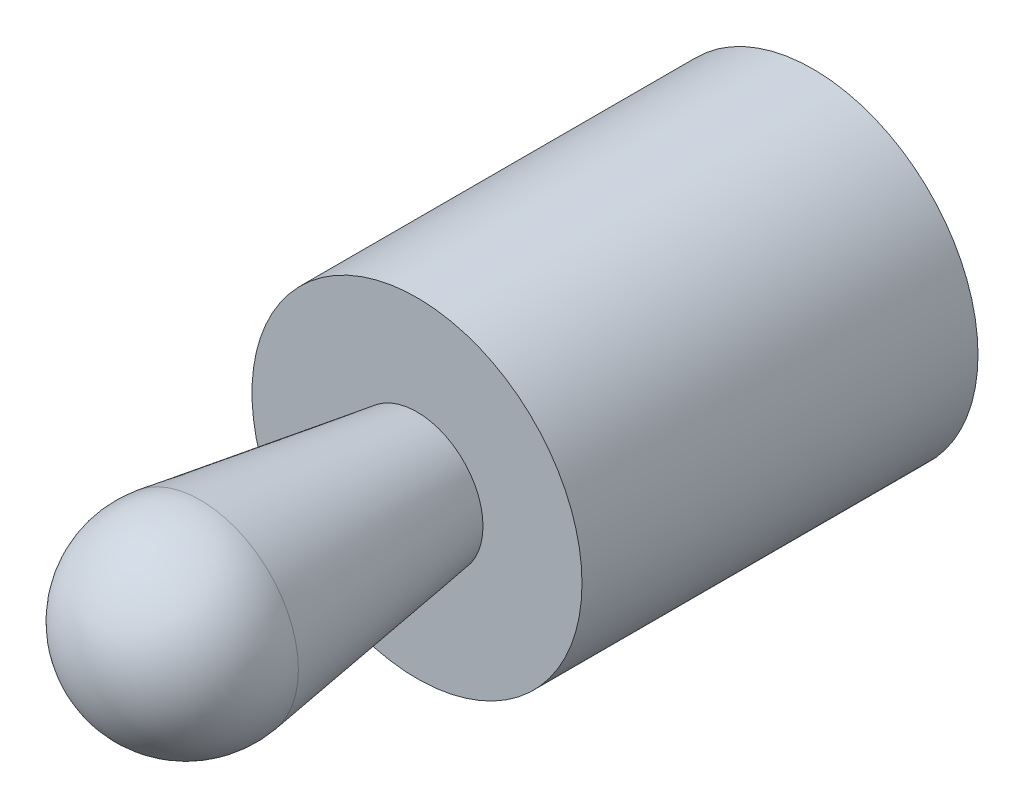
ISO-10303-21;
HEADER;
FILE_DESCRIPTION(('STEP AP214'),'2;1');
FILE_NAME('part.step','',(''),(''),'','','');
FILE_SCHEMA(('AUTOMOTIVE_DESIGN { 1 0 10303 214 1 1 1 1 }'));
ENDSEC;
DATA;
#1=APPLICATION_CONTEXT('core data for automotive mechanical design processes');
#2=APPLICATION_PROTOCOL_DEFINITION('international standard','automotive_design',2000,#1);
#3=PRODUCT_CONTEXT('',#1,'mechanical');
#4=PRODUCT('Part','Part','',(#3));
#5=PRODUCT_RELATED_PRODUCT_CATEGORY('part','',(#4));
#6=PRODUCT_DEFINITION_FORMATION('','',#4);
#7=PRODUCT_DEFINITION_CONTEXT('part definition',#1,'design');
#8=PRODUCT_DEFINITION('design','',#6,#7);
#9=PRODUCT_DEFINITION_SHAPE('','',#8);
#10=(LENGTH_UNIT() NAMED_UNIT(*) SI_UNIT(.MILLI.,.METRE.));
#11=(NAMED_UNIT(*) PLANE_ANGLE_UNIT() SI_UNIT($,.RADIAN.));
#12=(NAMED_UNIT(*) SI_UNIT($,.STERADIAN.) SOLID_ANGLE_UNIT());
#13=UNCERTAINTY_MEASURE_WITH_UNIT(LENGTH_MEASURE(1.E-05),#10,'distance_accuracy_value','');
#14=(GEOMETRIC_REPRESENTATION_CONTEXT(3) GLOBAL_UNCERTAINTY_ASSIGNED_CONTEXT((#13)) GLOBAL_UNIT_ASSIGNED_CONTEXT((#10,
#11,#12)) REPRESENTATION_CONTEXT('',''));
#15=CARTESIAN_POINT('',(0.,0.,0.));
#16=DIRECTION('',(0.,0.,1.));
#17=DIRECTION('',(1.,0.,0.));
#18=AXIS2_PLACEMENT_3D('',#15,#16,#17);
#19=CARTESIAN_POINT('',(0.,0.,0.));
#20=DIRECTION('',(0.,0.,1.));
#21=DIRECTION('',(1.,0.,0.));
#22=AXIS2_PLACEMENT_3D('',#19,#20,#21);
#23=PLANE('',#22);
#24=CARTESIAN_POINT('',(0.,0.,0.));
#25=DIRECTION('',(0.,0.,1.));
#26=DIRECTION('',(1.,0.,0.));
#27=AXIS2_PLACEMENT_3D('',#24,#25,#26);
#28=CIRCLE('',#27,5.);
#29=CARTESIAN_POINT('',(5.,0.,0.));
#30=VERTEX_POINT('',#29);
#31=EDGE_CURVE('E8',#30,#30,#28,.T.);
#32=ORIENTED_EDGE('',*,*,#31,.F.);
#33=EDGE_LOOP('',(#32));
#34=FACE_BOUND('',#33,.T.);
#35=ADVANCED_FACE('F12',(#34),#23,.F.);
#36=CARTESIAN_POINT('',(0.,0.,20.));
#37=DIRECTION('',(0.,0.,1.));
#38=DIRECTION('',(1.,0.,0.));
#39=AXIS2_PLACEMENT_3D('',#36,#37,#38);
#40=CYLINDRICAL_SURFACE('',#39,5.);
#41=CARTESIAN_POINT('',(0.,0.,12.));
#42=DIRECTION('',(0.,0.,1.));
#43=DIRECTION('',(1.,0.,0.));
#44=AXIS2_PLACEMENT_3D('',#41,#42,#43);
#45=CIRCLE('',#44,5.);
#46=CARTESIAN_POINT('',(5.,0.,12.));
#47=VERTEX_POINT('',#46);
#48=EDGE_CURVE('E18',#47,#47,#45,.T.);
#49=ORIENTED_EDGE('',*,*,#48,.F.);
#50=EDGE_LOOP('',(#49));
#51=FACE_BOUND('',#50,.T.);
#52=ORIENTED_EDGE('',*,*,#31,.T.);
#53=EDGE_LOOP('',(#52));
#54=FACE_BOUND('',#53,.T.);
#55=ADVANCED_FACE('F45',(#51,#54),#40,.T.);
#56=CARTESIAN_POINT('',(-2.,0.,12.));
#57=DIRECTION('',(0.,0.,1.));
#58=DIRECTION('',(1.,0.,0.));
#59=AXIS2_PLACEMENT_3D('',#56,#57,#58);
#60=PLANE('',#59);
#61=ORIENTED_EDGE('',*,*,#48,.T.);
#62=EDGE_LOOP('',(#61));
#63=FACE_BOUND('',#62,.T.);
#64=CARTESIAN_POINT('',(0.,0.,12.));
#65=DIRECTION('',(0.,0.,1.));
#66=DIRECTION('',(1.,0.,0.));
#67=AXIS2_PLACEMENT_3D('',#64,#65,#66);
#68=CIRCLE('',#67,2.);
#69=CARTESIAN_POINT('',(2.,0.,12.));
#70=VERTEX_POINT('',#69);
#71=EDGE_CURVE('E22',#70,#70,#68,.T.);
#72=ORIENTED_EDGE('',*,*,#71,.F.);
#73=EDGE_LOOP('',(#72));
#74=FACE_BOUND('',#73,.T.);
#75=ADVANCED_FACE('F36',(#63,#74),#60,.T.);
#76=CARTESIAN_POINT('',(0.,0.,18.5622546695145));
#77=DIRECTION('',(0.,0.,1.));
#78=DIRECTION('',(1.,0.,0.));
#79=AXIS2_PLACEMENT_3D('',#76,#77,#78);
#80=CONICAL_SURFACE('',#79,2.9678913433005,0.146437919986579);
#81=ORIENTED_EDGE('',*,*,#71,.T.);
#82=EDGE_LOOP('',(#81));
#83=FACE_BOUND('',#82,.T.);
#84=CARTESIAN_POINT('',(0.,0.,18.5622546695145));
#85=DIRECTION('',(0.,0.,1.));
#86=DIRECTION('',(1.,0.,0.));
#87=AXIS2_PLACEMENT_3D('',#84,#85,#86);
#88=CIRCLE('',#87,2.9678913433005);
#89=CARTESIAN_POINT('',(2.9678913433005,0.,18.5622546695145));
#90=VERTEX_POINT('',#89);
#91=EDGE_CURVE('E26',#90,#90,#88,.T.);
#92=ORIENTED_EDGE('',*,*,#91,.F.);
#93=EDGE_LOOP('',(#92));
#94=FACE_BOUND('',#93,.T.);
#95=ADVANCED_FACE('F34',(#83,#94),#80,.T.);
#96=CARTESIAN_POINT('',(0.,0.,19.));
#97=DIRECTION('',(0.,0.,1.));
#98=DIRECTION('',(1.,0.,0.));
#99=AXIS2_PLACEMENT_3D('',#96,#97,#98);
#100=SPHERICAL_SURFACE('',#99,3.);
#101=ORIENTED_EDGE('',*,*,#91,.T.);
#102=EDGE_LOOP('',(#101));
#103=FACE_BOUND('',#102,.T.);
#104=ADVANCED_FACE('F32',(#103),#100,.T.);
#105=CLOSED_SHELL('',(#35,#55,#75,#95,#104));
#106=MANIFOLD_SOLID_BREP('B1',#105);
#107=ADVANCED_BREP_SHAPE_REPRESENTATION('',(#18,#106),#14);
#108=SHAPE_DEFINITION_REPRESENTATION(#9,#107);
ENDSEC;
END-ISO-10303-21;
